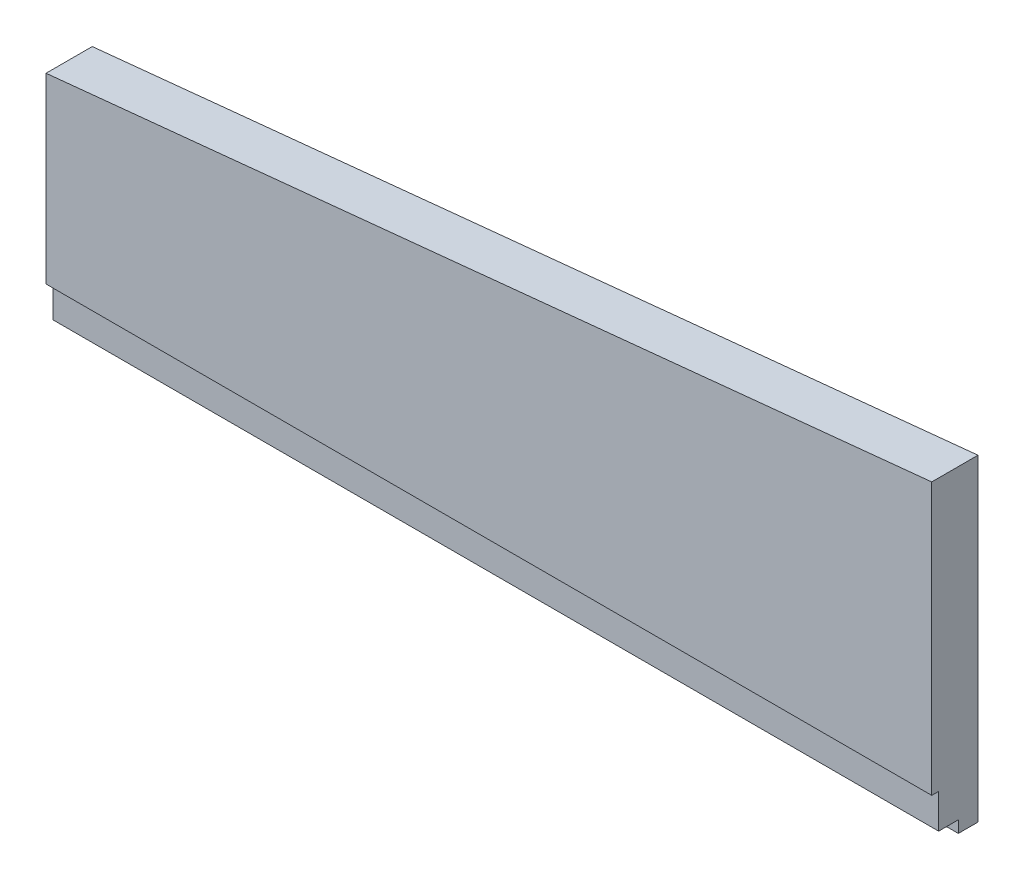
from build123d import *

# Parameters (mm, degrees)
EXTRUDE_1_DEPTH = 47
SKETCH_2_W      = 900
SKETCH_2_H      = 35
EXTRUDE_2_DEPTH = 40
SKETCH_3_W      = 900
SKETCH_3_H      = 12
EXTRUDE_3_DEPTH = 20


with BuildPart() as part:
    # Sketch 1 → Extrude 1 (new body)
    with BuildSketch(Plane.XY):
        Polygon((0, -1510.603294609), (0, -1786.460757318), (-900, -1786.460757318), (-900, -1601.000259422), align=None)
    extrude(amount=EXTRUDE_1_DEPTH)

    # Sketch 2 → Extrude 2 (add)
    with BuildSketch(Plane(origin=(0, 0, 0), x_dir=(-1, 0, 0), z_dir=(0, 0, -1))):
        with Locations((450, -1803.960757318)):
            Rectangle(SKETCH_2_W, SKETCH_2_H)
    extrude(amount=-EXTRUDE_2_DEPTH)

    # Sketch 3 → Extrude 3 (add)
    with BuildSketch(Plane(origin=(0, 0, 0), x_dir=(-1, 0, 0), z_dir=(0, 0, -1))):
        with Locations((450, -1827.460757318)):
            Rectangle(SKETCH_3_W, SKETCH_3_H)
    extrude(amount=-EXTRUDE_3_DEPTH)


solid = part.part
